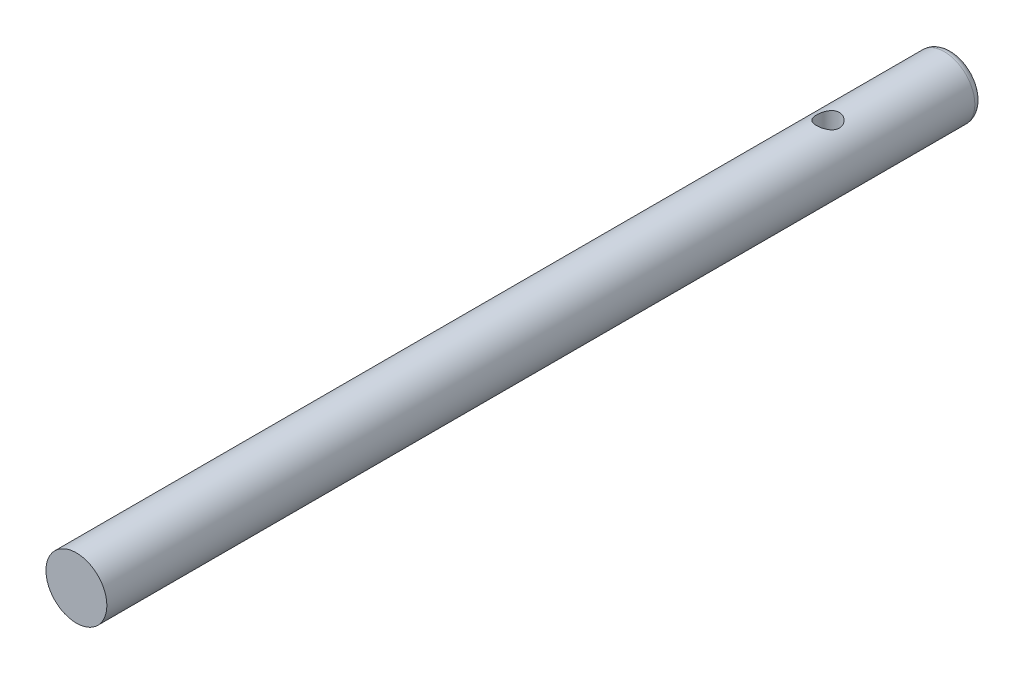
from build123d import *

# Parameters (mm, degrees)
SKETCH1_R               = 4
BOSS_EXTRUDE1_DEPTH     = 115
FILLET1_R               = 1
CUT_EXTRUDE1_DEPTH      = 10
CUT_EXTRUDE1_DEPTH_BACK = 10
SKETCH2_R               = 1.5


with BuildPart() as part:
    # Sketch1 → Boss-Extrude1 (new body)
    with BuildSketch(Plane.XY):
        Circle(SKETCH1_R)
    extrude(amount=BOSS_EXTRUDE1_DEPTH)

    # Fillet1
    fillet1_edges = [part.edges().sort_by_distance(p)[0] for p in [
        (-4, 0, 0),
    ]]
    fillet(fillet1_edges, radius=FILLET1_R)

    # Sketch2 → Cut-Extrude1 (cut, two sides: drawn at the far end of the back side and taken through both)
    with BuildSketch(Plane(origin=(0, 0, 0), x_dir=(1, 0, 0), z_dir=(0, 1, 0)).offset(-CUT_EXTRUDE1_DEPTH_BACK)):
        with Locations(Location((0, -16.3, 0), (0, 0, 90))):
            Circle(SKETCH2_R)
    extrude(amount=CUT_EXTRUDE1_DEPTH + CUT_EXTRUDE1_DEPTH_BACK, mode=Mode.SUBTRACT)


solid = part.part
